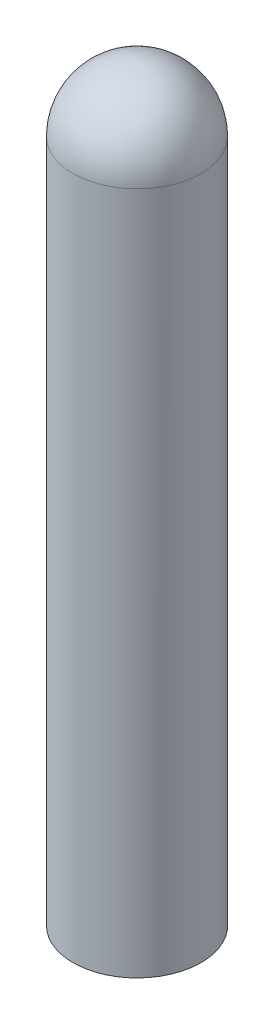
from build123d import *

# Parameters (mm, degrees)
ESQUISSE1_R       = 3.75
EXTRUSION1_DEPTH  = 40
D_ME1_FACE_RADIUS = 3.75
D_ME1_HEIGHT      = 3.75


with BuildPart() as part:
    # Esquisse1 → Extrusion1 (new body)
    with BuildSketch(Plane(origin=(0, 0, 0), x_dir=(1, 0, 0), z_dir=(0, 1, 0))):
        with Locations(Location((0, 0, 0), (0, 0, 90))):
            Circle(ESQUISSE1_R)
    extrude(amount=EXTRUSION1_DEPTH)

    # D_me1: a dome of height H over a round flat face of radius A is a cap of a sphere of radius (A * A + H * H) / (2 * H)
    d_me1_r = (D_ME1_FACE_RADIUS * D_ME1_FACE_RADIUS + D_ME1_HEIGHT * D_ME1_HEIGHT) / (2 * D_ME1_HEIGHT)
    d_me1_base = Plane((0, 40, 0), z_dir=(0, 1, 0))
    with Locations(d_me1_base.offset(D_ME1_HEIGHT - d_me1_r)):
        d_me1_ball = Sphere(d_me1_r, mode=Mode.PRIVATE)
    add(split(d_me1_ball, bisect_by=d_me1_base, keep=Keep.TOP, mode=Mode.PRIVATE))


solid = part.part
